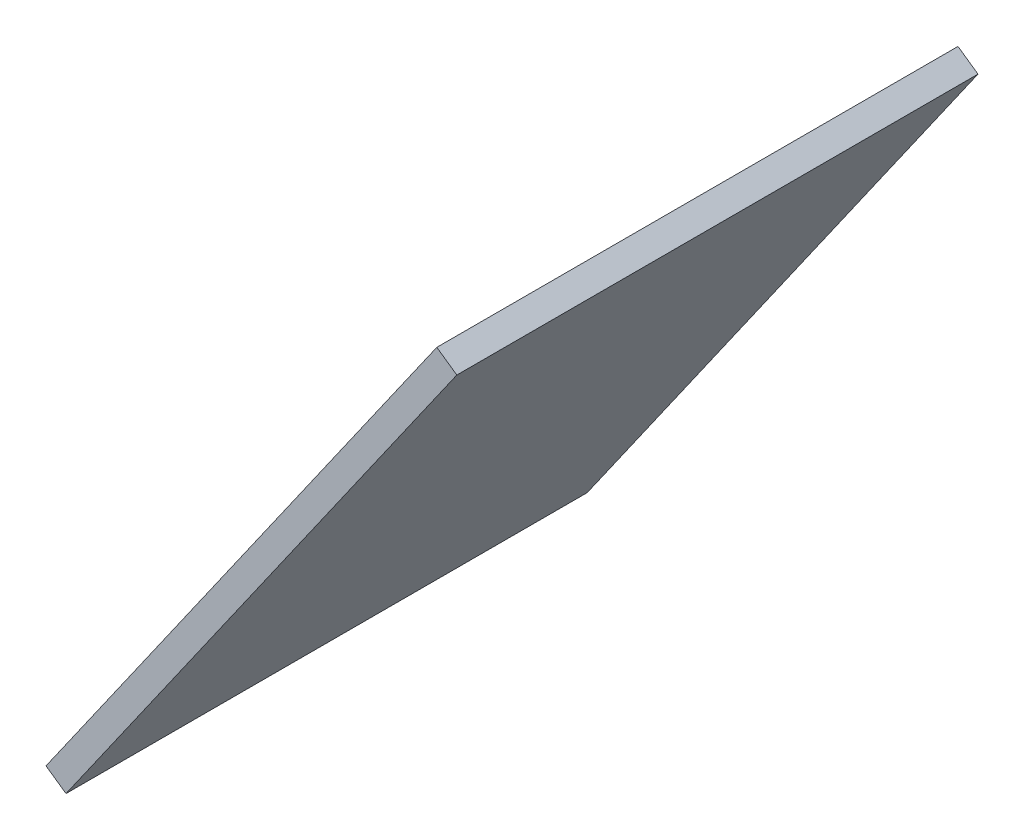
from build123d import *

# Parameters (mm, degrees)
BOSS_EXTRU_1_DEPTH = 1500


with BuildPart() as part:
    # Esquisse2 → Boss.-Extru.1 (new body)
    with BuildSketch(Plane.XY.offset(67.962031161)):
        Polygon((-4447.777386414, 17434.454500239), (-3322.952027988, 19040.106325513), (-3265.410383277, 18999.796029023), (-4390.235741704, 17394.144203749), align=None)
    extrude(amount=BOSS_EXTRU_1_DEPTH)


solid = part.part
